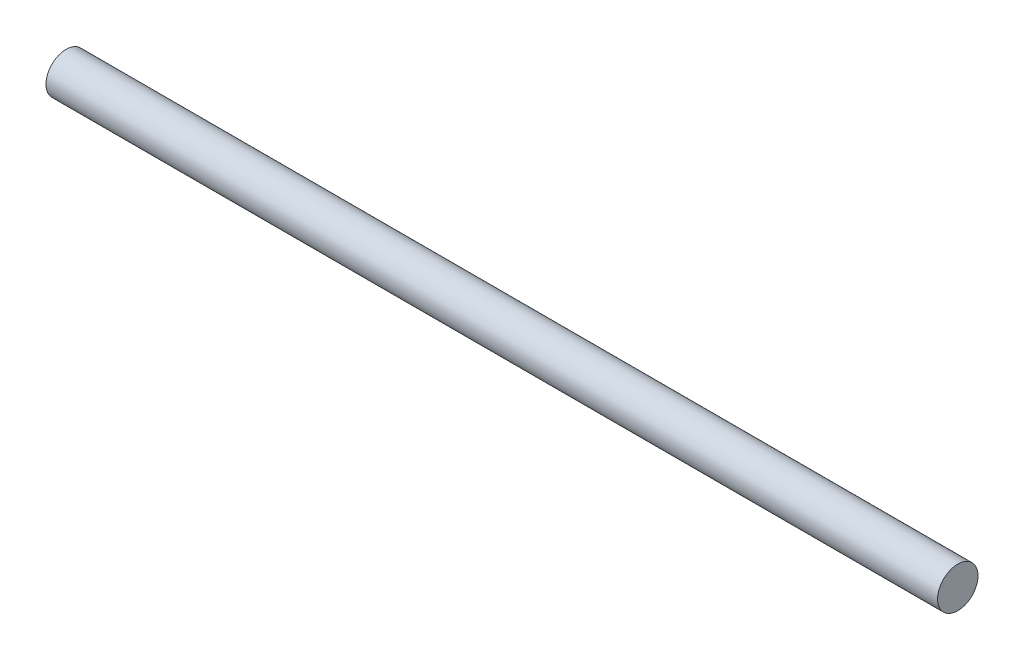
from build123d import *

# Parameters (mm, degrees)
SKETCH1_R           = 3.175
BOSS_EXTRUDE1_DEPTH = 140


with BuildPart() as part:
    # Sketch1 → Boss-Extrude1 (new body)
    with BuildSketch(Plane(origin=(0, 0, 0), x_dir=(0, 0, -1), z_dir=(1, 0, 0))):
        Circle(SKETCH1_R)
    extrude(amount=BOSS_EXTRUDE1_DEPTH)


solid = part.part
